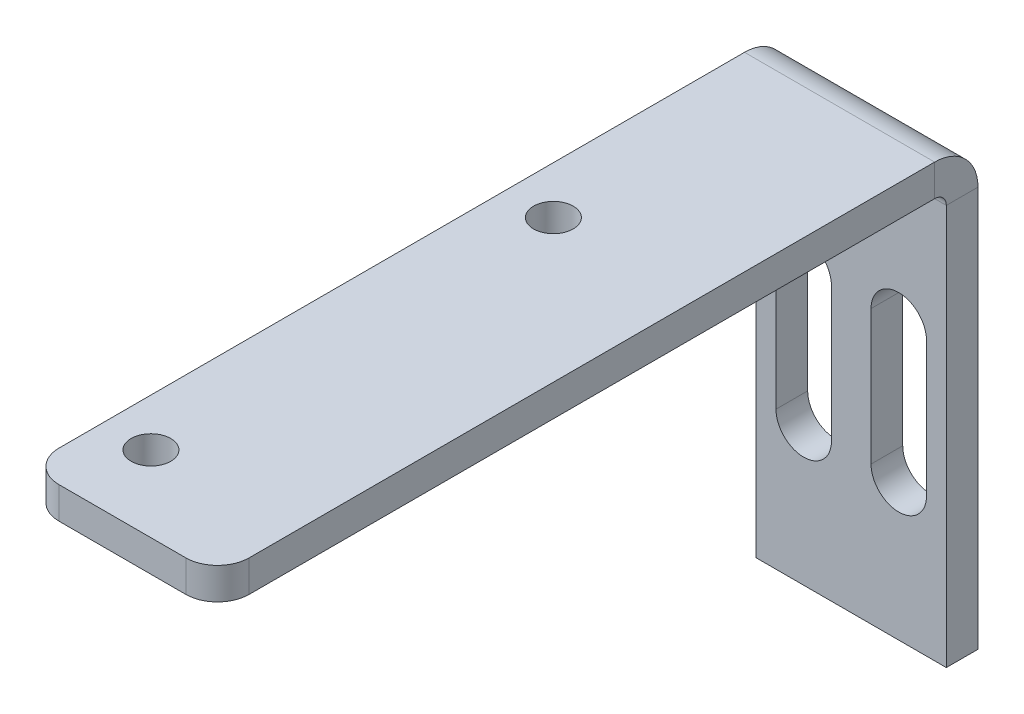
ISO-10303-21;
HEADER;
FILE_DESCRIPTION(('STEP AP214'),'2;1');
FILE_NAME('part.step','',(''),(''),'','','');
FILE_SCHEMA(('AUTOMOTIVE_DESIGN { 1 0 10303 214 1 1 1 1 }'));
ENDSEC;
DATA;
#1=APPLICATION_CONTEXT('core data for automotive mechanical design processes');
#2=APPLICATION_PROTOCOL_DEFINITION('international standard','automotive_design',2000,#1);
#3=PRODUCT_CONTEXT('',#1,'mechanical');
#4=PRODUCT('Part','Part','',(#3));
#5=PRODUCT_RELATED_PRODUCT_CATEGORY('part','',(#4));
#6=PRODUCT_DEFINITION_FORMATION('','',#4);
#7=PRODUCT_DEFINITION_CONTEXT('part definition',#1,'design');
#8=PRODUCT_DEFINITION('design','',#6,#7);
#9=PRODUCT_DEFINITION_SHAPE('','',#8);
#10=(LENGTH_UNIT() NAMED_UNIT(*) SI_UNIT(.MILLI.,.METRE.));
#11=(NAMED_UNIT(*) PLANE_ANGLE_UNIT() SI_UNIT($,.RADIAN.));
#12=(NAMED_UNIT(*) SI_UNIT($,.STERADIAN.) SOLID_ANGLE_UNIT());
#13=UNCERTAINTY_MEASURE_WITH_UNIT(LENGTH_MEASURE(1.E-05),#10,'distance_accuracy_value','');
#14=(GEOMETRIC_REPRESENTATION_CONTEXT(3) GLOBAL_UNCERTAINTY_ASSIGNED_CONTEXT((#13)) GLOBAL_UNIT_ASSIGNED_CONTEXT((#10,
#11,#12)) REPRESENTATION_CONTEXT('',''));
#15=CARTESIAN_POINT('',(0.,0.,0.));
#16=DIRECTION('',(0.,0.,1.));
#17=DIRECTION('',(1.,0.,0.));
#18=AXIS2_PLACEMENT_3D('',#15,#16,#17);
#19=CARTESIAN_POINT('',(0.,0.,0.));
#20=DIRECTION('',(0.,0.,1.));
#21=DIRECTION('',(1.,0.,0.));
#22=AXIS2_PLACEMENT_3D('',#19,#20,#21);
#23=PLANE('',#22);
#24=CARTESIAN_POINT('',(9.,182.48555223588,0.));
#25=DIRECTION('',(0.,0.,1.));
#26=DIRECTION('',(1.,0.,0.));
#27=AXIS2_PLACEMENT_3D('',#24,#25,#26);
#28=CIRCLE('',#27,1.75);
#29=CARTESIAN_POINT('',(7.25,182.48555223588,0.));
#30=VERTEX_POINT('',#29);
#31=CARTESIAN_POINT('',(10.75,182.48555223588,0.));
#32=VERTEX_POINT('',#31);
#33=EDGE_CURVE('E195',#30,#32,#28,.T.);
#34=ORIENTED_EDGE('',*,*,#33,.F.);
#35=DIRECTION('',(0.,-1.,0.));
#36=VECTOR('',#35,1.);
#37=CARTESIAN_POINT('',(7.25,190.985552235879,0.));
#38=LINE('',#37,#36);
#39=CARTESIAN_POINT('',(7.25,190.985552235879,0.));
#40=VERTEX_POINT('',#39);
#41=EDGE_CURVE('E171',#40,#30,#38,.T.);
#42=ORIENTED_EDGE('',*,*,#41,.F.);
#43=CARTESIAN_POINT('',(9.,190.985552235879,0.));
#44=DIRECTION('',(0.,0.,1.));
#45=DIRECTION('',(1.,0.,0.));
#46=AXIS2_PLACEMENT_3D('',#43,#44,#45);
#47=CIRCLE('',#46,1.75);
#48=CARTESIAN_POINT('',(10.75,190.985552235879,0.));
#49=VERTEX_POINT('',#48);
#50=EDGE_CURVE('E185',#49,#40,#47,.T.);
#51=ORIENTED_EDGE('',*,*,#50,.F.);
#52=DIRECTION('',(0.,-1.,0.));
#53=VECTOR('',#52,1.);
#54=CARTESIAN_POINT('',(10.75,190.985552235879,0.));
#55=LINE('',#54,#53);
#56=EDGE_CURVE('E179',#49,#32,#55,.T.);
#57=ORIENTED_EDGE('',*,*,#56,.T.);
#58=EDGE_LOOP('',(#34,#42,#51,#57));
#59=FACE_BOUND('',#58,.T.);
#60=DIRECTION('',(0.,1.,0.));
#61=VECTOR('',#60,1.);
#62=CARTESIAN_POINT('',(12.,173.73555223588,0.));
#63=LINE('',#62,#61);
#64=CARTESIAN_POINT('',(12.,173.73555223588,0.));
#65=VERTEX_POINT('',#64);
#66=CARTESIAN_POINT('',(12.,198.998952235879,0.));
#67=VERTEX_POINT('',#66);
#68=EDGE_CURVE('E251',#65,#67,#63,.T.);
#69=ORIENTED_EDGE('',*,*,#68,.T.);
#70=DIRECTION('',(-1.,0.,0.));
#71=VECTOR('',#70,1.);
#72=CARTESIAN_POINT('',(0.,198.998952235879,0.));
#73=LINE('',#72,#71);
#74=CARTESIAN_POINT('',(0.,198.998952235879,0.));
#75=VERTEX_POINT('',#74);
#76=EDGE_CURVE('E243',#75,#67,#73,.F.);
#77=ORIENTED_EDGE('',*,*,#76,.F.);
#78=DIRECTION('',(0.,-1.,0.));
#79=VECTOR('',#78,1.);
#80=CARTESIAN_POINT('',(0.,173.73555223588,0.));
#81=LINE('',#80,#79);
#82=CARTESIAN_POINT('',(0.,173.73555223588,0.));
#83=VERTEX_POINT('',#82);
#84=EDGE_CURVE('E266',#75,#83,#81,.T.);
#85=ORIENTED_EDGE('',*,*,#84,.T.);
#86=DIRECTION('',(1.,0.,0.));
#87=VECTOR('',#86,1.);
#88=CARTESIAN_POINT('',(12.,173.73555223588,0.));
#89=LINE('',#88,#87);
#90=EDGE_CURVE('E258',#83,#65,#89,.T.);
#91=ORIENTED_EDGE('',*,*,#90,.T.);
#92=EDGE_LOOP('',(#69,#77,#85,#91));
#93=FACE_BOUND('',#92,.T.);
#94=CARTESIAN_POINT('',(3.,190.985552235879,0.));
#95=DIRECTION('',(0.,0.,1.));
#96=DIRECTION('',(1.,0.,0.));
#97=AXIS2_PLACEMENT_3D('',#94,#95,#96);
#98=CIRCLE('',#97,1.75);
#99=CARTESIAN_POINT('',(4.75,190.985552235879,0.));
#100=VERTEX_POINT('',#99);
#101=CARTESIAN_POINT('',(1.25,190.985552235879,0.));
#102=VERTEX_POINT('',#101);
#103=EDGE_CURVE('E40',#100,#102,#98,.T.);
#104=ORIENTED_EDGE('',*,*,#103,.F.);
#105=DIRECTION('',(0.,-1.,0.));
#106=VECTOR('',#105,1.);
#107=CARTESIAN_POINT('',(4.75,190.985552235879,0.));
#108=LINE('',#107,#106);
#109=CARTESIAN_POINT('',(4.75,182.48555223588,0.));
#110=VERTEX_POINT('',#109);
#111=EDGE_CURVE('E144',#100,#110,#108,.T.);
#112=ORIENTED_EDGE('',*,*,#111,.T.);
#113=CARTESIAN_POINT('',(3.,182.48555223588,0.));
#114=DIRECTION('',(0.,0.,1.));
#115=DIRECTION('',(1.,0.,0.));
#116=AXIS2_PLACEMENT_3D('',#113,#114,#115);
#117=CIRCLE('',#116,1.75);
#118=CARTESIAN_POINT('',(1.24999999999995,182.48555223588,0.));
#119=VERTEX_POINT('',#118);
#120=EDGE_CURVE('E164',#119,#110,#117,.T.);
#121=ORIENTED_EDGE('',*,*,#120,.F.);
#122=DIRECTION('',(0.,-1.,0.));
#123=VECTOR('',#122,1.);
#124=CARTESIAN_POINT('',(1.24999999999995,190.985552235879,0.));
#125=LINE('',#124,#123);
#126=EDGE_CURVE('E157',#102,#119,#125,.T.);
#127=ORIENTED_EDGE('',*,*,#126,.F.);
#128=EDGE_LOOP('',(#104,#112,#121,#127));
#129=FACE_BOUND('',#128,.T.);
#130=ADVANCED_FACE('F16',(#59,#93,#129),#23,.T.);
#131=CARTESIAN_POINT('',(0.,0.,-2.));
#132=DIRECTION('',(0.,0.,1.));
#133=DIRECTION('',(1.,0.,0.));
#134=AXIS2_PLACEMENT_3D('',#131,#132,#133);
#135=PLANE('',#134);
#136=DIRECTION('',(0.,-1.,0.));
#137=VECTOR('',#136,1.);
#138=CARTESIAN_POINT('',(1.25,190.985552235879,-2.));
#139=LINE('',#138,#137);
#140=CARTESIAN_POINT('',(1.25,190.985552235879,-2.));
#141=VERTEX_POINT('',#140);
#142=CARTESIAN_POINT('',(1.25,182.48555223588,-2.));
#143=VERTEX_POINT('',#142);
#144=EDGE_CURVE('E292',#141,#143,#139,.T.);
#145=ORIENTED_EDGE('',*,*,#144,.T.);
#146=CARTESIAN_POINT('',(3.,182.48555223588,-2.));
#147=DIRECTION('',(0.,0.,1.));
#148=DIRECTION('',(1.,0.,0.));
#149=AXIS2_PLACEMENT_3D('',#146,#147,#148);
#150=CIRCLE('',#149,1.75);
#151=CARTESIAN_POINT('',(4.75,182.48555223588,-2.));
#152=VERTEX_POINT('',#151);
#153=EDGE_CURVE('E166',#143,#152,#150,.T.);
#154=ORIENTED_EDGE('',*,*,#153,.T.);
#155=DIRECTION('',(0.,-1.,0.));
#156=VECTOR('',#155,1.);
#157=CARTESIAN_POINT('',(4.75,190.985552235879,-2.));
#158=LINE('',#157,#156);
#159=CARTESIAN_POINT('',(4.75,190.985552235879,-2.));
#160=VERTEX_POINT('',#159);
#161=EDGE_CURVE('E149',#160,#152,#158,.T.);
#162=ORIENTED_EDGE('',*,*,#161,.F.);
#163=CARTESIAN_POINT('',(3.,190.985552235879,-2.));
#164=DIRECTION('',(0.,0.,1.));
#165=DIRECTION('',(1.,0.,0.));
#166=AXIS2_PLACEMENT_3D('',#163,#164,#165);
#167=CIRCLE('',#166,1.75);
#168=EDGE_CURVE('E153',#160,#141,#167,.T.);
#169=ORIENTED_EDGE('',*,*,#168,.T.);
#170=EDGE_LOOP('',(#145,#154,#162,#169));
#171=FACE_BOUND('',#170,.T.);
#172=DIRECTION('',(-1.,0.,0.));
#173=VECTOR('',#172,1.);
#174=CARTESIAN_POINT('',(0.,198.998952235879,-2.));
#175=LINE('',#174,#173);
#176=CARTESIAN_POINT('',(0.,198.998952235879,-2.));
#177=VERTEX_POINT('',#176);
#178=CARTESIAN_POINT('',(12.,198.998952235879,-2.));
#179=VERTEX_POINT('',#178);
#180=EDGE_CURVE('E231',#177,#179,#175,.F.);
#181=ORIENTED_EDGE('',*,*,#180,.T.);
#182=DIRECTION('',(0.,1.,0.));
#183=VECTOR('',#182,1.);
#184=CARTESIAN_POINT('',(12.,173.73555223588,-2.));
#185=LINE('',#184,#183);
#186=CARTESIAN_POINT('',(12.,173.73555223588,-2.));
#187=VERTEX_POINT('',#186);
#188=EDGE_CURVE('E254',#187,#179,#185,.T.);
#189=ORIENTED_EDGE('',*,*,#188,.F.);
#190=DIRECTION('',(1.,0.,0.));
#191=VECTOR('',#190,1.);
#192=CARTESIAN_POINT('',(12.,173.73555223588,-2.));
#193=LINE('',#192,#191);
#194=CARTESIAN_POINT('',(0.,173.73555223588,-2.));
#195=VERTEX_POINT('',#194);
#196=EDGE_CURVE('E260',#195,#187,#193,.T.);
#197=ORIENTED_EDGE('',*,*,#196,.F.);
#198=DIRECTION('',(0.,-1.,0.));
#199=VECTOR('',#198,1.);
#200=CARTESIAN_POINT('',(0.,173.73555223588,-2.));
#201=LINE('',#200,#199);
#202=EDGE_CURVE('E257',#177,#195,#201,.T.);
#203=ORIENTED_EDGE('',*,*,#202,.F.);
#204=EDGE_LOOP('',(#181,#189,#197,#203));
#205=FACE_BOUND('',#204,.T.);
#206=DIRECTION('',(0.,-1.,0.));
#207=VECTOR('',#206,1.);
#208=CARTESIAN_POINT('',(10.75,190.985552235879,-2.));
#209=LINE('',#208,#207);
#210=CARTESIAN_POINT('',(10.75,190.985552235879,-2.));
#211=VERTEX_POINT('',#210);
#212=CARTESIAN_POINT('',(10.75,182.48555223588,-2.));
#213=VERTEX_POINT('',#212);
#214=EDGE_CURVE('E176',#211,#213,#209,.T.);
#215=ORIENTED_EDGE('',*,*,#214,.F.);
#216=CARTESIAN_POINT('',(9.,190.985552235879,-2.));
#217=DIRECTION('',(0.,0.,1.));
#218=DIRECTION('',(1.,0.,0.));
#219=AXIS2_PLACEMENT_3D('',#216,#217,#218);
#220=CIRCLE('',#219,1.75);
#221=CARTESIAN_POINT('',(7.25,190.985552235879,-2.));
#222=VERTEX_POINT('',#221);
#223=EDGE_CURVE('E187',#211,#222,#220,.T.);
#224=ORIENTED_EDGE('',*,*,#223,.T.);
#225=DIRECTION('',(0.,-1.,0.));
#226=VECTOR('',#225,1.);
#227=CARTESIAN_POINT('',(7.25,190.985552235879,-2.));
#228=LINE('',#227,#226);
#229=CARTESIAN_POINT('',(7.25,182.48555223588,-2.));
#230=VERTEX_POINT('',#229);
#231=EDGE_CURVE('E173',#222,#230,#228,.T.);
#232=ORIENTED_EDGE('',*,*,#231,.T.);
#233=CARTESIAN_POINT('',(9.,182.48555223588,-2.));
#234=DIRECTION('',(0.,0.,1.));
#235=DIRECTION('',(1.,0.,0.));
#236=AXIS2_PLACEMENT_3D('',#233,#234,#235);
#237=CIRCLE('',#236,1.75);
#238=EDGE_CURVE('E197',#230,#213,#237,.T.);
#239=ORIENTED_EDGE('',*,*,#238,.T.);
#240=EDGE_LOOP('',(#215,#224,#232,#239));
#241=FACE_BOUND('',#240,.T.);
#242=ADVANCED_FACE('F306',(#171,#205,#241),#135,.F.);
#243=CARTESIAN_POINT('',(0.,173.73555223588,-2.));
#244=DIRECTION('',(-1.,0.,0.));
#245=DIRECTION('',(0.,0.,1.));
#246=AXIS2_PLACEMENT_3D('',#243,#244,#245);
#247=PLANE('',#246);
#248=ORIENTED_EDGE('',*,*,#84,.F.);
#249=DIRECTION('',(0.,0.,-1.));
#250=VECTOR('',#249,1.);
#251=CARTESIAN_POINT('',(0.,198.998952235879,0.));
#252=LINE('',#251,#250);
#253=EDGE_CURVE('E237',#75,#177,#252,.T.);
#254=ORIENTED_EDGE('',*,*,#253,.T.);
#255=ORIENTED_EDGE('',*,*,#202,.T.);
#256=DIRECTION('',(0.,0.,1.));
#257=VECTOR('',#256,1.);
#258=CARTESIAN_POINT('',(0.,173.73555223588,-2.));
#259=LINE('',#258,#257);
#260=EDGE_CURVE('E263',#195,#83,#259,.T.);
#261=ORIENTED_EDGE('',*,*,#260,.T.);
#262=EDGE_LOOP('',(#248,#254,#255,#261));
#263=FACE_BOUND('',#262,.T.);
#264=ADVANCED_FACE('F332',(#263),#247,.T.);
#265=CARTESIAN_POINT('',(12.,173.73555223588,-2.));
#266=DIRECTION('',(1.,0.,0.));
#267=DIRECTION('',(0.,0.,-1.));
#268=AXIS2_PLACEMENT_3D('',#265,#266,#267);
#269=PLANE('',#268);
#270=DIRECTION('',(0.,0.,-1.));
#271=VECTOR('',#270,1.);
#272=CARTESIAN_POINT('',(12.,198.998952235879,0.));
#273=LINE('',#272,#271);
#274=EDGE_CURVE('E248',#67,#179,#273,.T.);
#275=ORIENTED_EDGE('',*,*,#274,.F.);
#276=ORIENTED_EDGE('',*,*,#68,.F.);
#277=DIRECTION('',(0.,0.,1.));
#278=VECTOR('',#277,1.);
#279=CARTESIAN_POINT('',(12.,173.73555223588,-2.));
#280=LINE('',#279,#278);
#281=EDGE_CURVE('E270',#187,#65,#280,.T.);
#282=ORIENTED_EDGE('',*,*,#281,.F.);
#283=ORIENTED_EDGE('',*,*,#188,.T.);
#284=EDGE_LOOP('',(#275,#276,#282,#283));
#285=FACE_BOUND('',#284,.T.);
#286=ADVANCED_FACE('F342',(#285),#269,.T.);
#287=CARTESIAN_POINT('',(12.,173.73555223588,-2.));
#288=DIRECTION('',(0.,-1.,0.));
#289=DIRECTION('',(0.,0.,-1.));
#290=AXIS2_PLACEMENT_3D('',#287,#288,#289);
#291=PLANE('',#290);
#292=ORIENTED_EDGE('',*,*,#90,.F.);
#293=ORIENTED_EDGE('',*,*,#260,.F.);
#294=ORIENTED_EDGE('',*,*,#196,.T.);
#295=ORIENTED_EDGE('',*,*,#281,.T.);
#296=EDGE_LOOP('',(#292,#293,#294,#295));
#297=FACE_BOUND('',#296,.T.);
#298=ADVANCED_FACE('F338',(#297),#291,.T.);
#299=CARTESIAN_POINT('',(12.,198.998952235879,0.7366));
#300=DIRECTION('',(1.,0.,0.));
#301=DIRECTION('',(0.,0.,-1.));
#302=AXIS2_PLACEMENT_3D('',#299,#300,#301);
#303=PLANE('',#302);
#304=DIRECTION('',(0.,-1.,0.));
#305=VECTOR('',#304,1.);
#306=CARTESIAN_POINT('',(12.,201.735552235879,0.7366));
#307=LINE('',#306,#305);
#308=CARTESIAN_POINT('',(12.,199.735552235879,0.7366));
#309=VERTEX_POINT('',#308);
#310=CARTESIAN_POINT('',(12.,201.735552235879,0.7366));
#311=VERTEX_POINT('',#310);
#312=EDGE_CURVE('E203',#309,#311,#307,.F.);
#313=ORIENTED_EDGE('',*,*,#312,.F.);
#314=CARTESIAN_POINT('',(12.,198.998952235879,0.7366));
#315=DIRECTION('',(-1.,0.,0.));
#316=DIRECTION('',(0.,0.,1.));
#317=AXIS2_PLACEMENT_3D('',#314,#315,#316);
#318=CIRCLE('',#317,0.7366);
#319=EDGE_CURVE('E240',#67,#309,#318,.F.);
#320=ORIENTED_EDGE('',*,*,#319,.F.);
#321=ORIENTED_EDGE('',*,*,#274,.T.);
#322=CARTESIAN_POINT('',(12.,198.998952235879,0.7366));
#323=DIRECTION('',(-1.,0.,0.));
#324=DIRECTION('',(0.,0.,1.));
#325=AXIS2_PLACEMENT_3D('',#322,#323,#324);
#326=CIRCLE('',#325,2.7366);
#327=EDGE_CURVE('E233',#179,#311,#326,.F.);
#328=ORIENTED_EDGE('',*,*,#327,.T.);
#329=EDGE_LOOP('',(#313,#320,#321,#328));
#330=FACE_BOUND('',#329,.T.);
#331=ADVANCED_FACE('F341',(#330),#303,.T.);
#332=CARTESIAN_POINT('',(0.,198.998952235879,0.7366));
#333=DIRECTION('',(1.,0.,0.));
#334=DIRECTION('',(0.,0.,-1.));
#335=AXIS2_PLACEMENT_3D('',#332,#333,#334);
#336=PLANE('',#335);
#337=CARTESIAN_POINT('',(0.,198.998952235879,0.7366));
#338=DIRECTION('',(-1.,0.,0.));
#339=DIRECTION('',(0.,0.,1.));
#340=AXIS2_PLACEMENT_3D('',#337,#338,#339);
#341=CIRCLE('',#340,0.7366);
#342=CARTESIAN_POINT('',(0.,199.735552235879,0.7366));
#343=VERTEX_POINT('',#342);
#344=EDGE_CURVE('E207',#343,#75,#341,.T.);
#345=ORIENTED_EDGE('',*,*,#344,.F.);
#346=DIRECTION('',(0.,-1.,0.));
#347=VECTOR('',#346,1.);
#348=CARTESIAN_POINT('',(0.,199.735552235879,0.7366));
#349=LINE('',#348,#347);
#350=CARTESIAN_POINT('',(0.,201.735552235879,0.7366));
#351=VERTEX_POINT('',#350);
#352=EDGE_CURVE('E224',#343,#351,#349,.F.);
#353=ORIENTED_EDGE('',*,*,#352,.T.);
#354=CARTESIAN_POINT('',(0.,198.998952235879,0.7366));
#355=DIRECTION('',(-1.,0.,0.));
#356=DIRECTION('',(0.,0.,1.));
#357=AXIS2_PLACEMENT_3D('',#354,#355,#356);
#358=CIRCLE('',#357,2.7366);
#359=EDGE_CURVE('E234',#351,#177,#358,.T.);
#360=ORIENTED_EDGE('',*,*,#359,.T.);
#361=ORIENTED_EDGE('',*,*,#253,.F.);
#362=EDGE_LOOP('',(#345,#353,#360,#361));
#363=FACE_BOUND('',#362,.T.);
#364=ADVANCED_FACE('F393',(#363),#336,.F.);
#365=CARTESIAN_POINT('',(0.,198.998952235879,0.7366));
#366=DIRECTION('',(-1.,0.,0.));
#367=DIRECTION('',(0.,1.,0.));
#368=AXIS2_PLACEMENT_3D('',#365,#366,#367);
#369=CYLINDRICAL_SURFACE('',#368,2.7366);
#370=ORIENTED_EDGE('',*,*,#180,.F.);
#371=ORIENTED_EDGE('',*,*,#359,.F.);
#372=DIRECTION('',(-1.,0.,0.));
#373=VECTOR('',#372,1.);
#374=CARTESIAN_POINT('',(12.,201.735552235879,0.7366));
#375=LINE('',#374,#373);
#376=EDGE_CURVE('E221',#351,#311,#375,.F.);
#377=ORIENTED_EDGE('',*,*,#376,.T.);
#378=ORIENTED_EDGE('',*,*,#327,.F.);
#379=EDGE_LOOP('',(#370,#371,#377,#378));
#380=FACE_BOUND('',#379,.T.);
#381=ADVANCED_FACE('F397',(#380),#369,.T.);
#382=CARTESIAN_POINT('',(0.,198.998952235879,0.7366));
#383=DIRECTION('',(-1.,0.,0.));
#384=DIRECTION('',(0.,1.,0.));
#385=AXIS2_PLACEMENT_3D('',#382,#383,#384);
#386=CYLINDRICAL_SURFACE('',#385,0.7366);
#387=ORIENTED_EDGE('',*,*,#76,.T.);
#388=ORIENTED_EDGE('',*,*,#319,.T.);
#389=DIRECTION('',(-1.,0.,0.));
#390=VECTOR('',#389,1.);
#391=CARTESIAN_POINT('',(12.,199.735552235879,0.7366));
#392=LINE('',#391,#390);
#393=EDGE_CURVE('E227',#309,#343,#392,.T.);
#394=ORIENTED_EDGE('',*,*,#393,.T.);
#395=ORIENTED_EDGE('',*,*,#344,.T.);
#396=EDGE_LOOP('',(#387,#388,#394,#395));
#397=FACE_BOUND('',#396,.T.);
#398=ADVANCED_FACE('F385',(#397),#386,.F.);
#399=CARTESIAN_POINT('',(12.,201.735552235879,0.));
#400=DIRECTION('',(-1.,0.,0.));
#401=DIRECTION('',(0.,0.,1.));
#402=AXIS2_PLACEMENT_3D('',#399,#400,#401);
#403=PLANE('',#402);
#404=DIRECTION('',(0.,0.,-1.));
#405=VECTOR('',#404,1.);
#406=CARTESIAN_POINT('',(12.,201.735552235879,-7.37324663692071E-13));
#407=LINE('',#406,#405);
#408=CARTESIAN_POINT('',(12.,201.73555223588,44.));
#409=VERTEX_POINT('',#408);
#410=EDGE_CURVE('E211',#409,#311,#407,.T.);
#411=ORIENTED_EDGE('',*,*,#410,.F.);
#412=DIRECTION('',(0.,-1.,0.));
#413=VECTOR('',#412,1.);
#414=CARTESIAN_POINT('',(12.,201.73555223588,44.));
#415=LINE('',#414,#413);
#416=CARTESIAN_POINT('',(12.,199.73555223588,44.));
#417=VERTEX_POINT('',#416);
#418=EDGE_CURVE('E11',#409,#417,#415,.T.);
#419=ORIENTED_EDGE('',*,*,#418,.T.);
#420=DIRECTION('',(0.,0.,1.));
#421=VECTOR('',#420,1.);
#422=CARTESIAN_POINT('',(12.,199.735552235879,0.));
#423=LINE('',#422,#421);
#424=EDGE_CURVE('E219',#417,#309,#423,.F.);
#425=ORIENTED_EDGE('',*,*,#424,.T.);
#426=ORIENTED_EDGE('',*,*,#312,.T.);
#427=EDGE_LOOP('',(#411,#419,#425,#426));
#428=FACE_BOUND('',#427,.T.);
#429=ADVANCED_FACE('F377',(#428),#403,.F.);
#430=CARTESIAN_POINT('',(0.,201.73555223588,46.));
#431=DIRECTION('',(1.,0.,0.));
#432=DIRECTION('',(0.,0.,-1.));
#433=AXIS2_PLACEMENT_3D('',#430,#431,#432);
#434=PLANE('',#433);
#435=DIRECTION('',(0.,0.,-1.));
#436=VECTOR('',#435,1.);
#437=CARTESIAN_POINT('',(0.,199.73555223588,46.));
#438=LINE('',#437,#436);
#439=CARTESIAN_POINT('',(0.,199.73555223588,44.));
#440=VERTEX_POINT('',#439);
#441=EDGE_CURVE('E216',#343,#440,#438,.F.);
#442=ORIENTED_EDGE('',*,*,#441,.T.);
#443=DIRECTION('',(0.,-1.,0.));
#444=VECTOR('',#443,1.);
#445=CARTESIAN_POINT('',(0.,201.73555223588,44.));
#446=LINE('',#445,#444);
#447=CARTESIAN_POINT('',(0.,201.73555223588,44.));
#448=VERTEX_POINT('',#447);
#449=EDGE_CURVE('E283',#440,#448,#446,.F.);
#450=ORIENTED_EDGE('',*,*,#449,.T.);
#451=DIRECTION('',(0.,0.,1.));
#452=VECTOR('',#451,1.);
#453=CARTESIAN_POINT('',(0.,201.735552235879,-7.37324663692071E-13));
#454=LINE('',#453,#452);
#455=EDGE_CURVE('E208',#351,#448,#454,.T.);
#456=ORIENTED_EDGE('',*,*,#455,.F.);
#457=ORIENTED_EDGE('',*,*,#352,.F.);
#458=EDGE_LOOP('',(#442,#450,#456,#457));
#459=FACE_BOUND('',#458,.T.);
#460=ADVANCED_FACE('F391',(#459),#434,.F.);
#461=CARTESIAN_POINT('',(0.,201.735552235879,-7.37324663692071E-13));
#462=DIRECTION('',(0.,-1.,0.));
#463=DIRECTION('',(0.,0.,-1.));
#464=AXIS2_PLACEMENT_3D('',#461,#462,#463);
#465=PLANE('',#464);
#466=CARTESIAN_POINT('',(3.,201.735552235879,15.8000000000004));
#467=DIRECTION('',(0.,1.,0.));
#468=DIRECTION('',(0.,0.,1.));
#469=AXIS2_PLACEMENT_3D('',#466,#467,#468);
#470=CIRCLE('',#469,1.24999999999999);
#471=CARTESIAN_POINT('',(3.,201.735552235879,17.0500000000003));
#472=VERTEX_POINT('',#471);
#473=EDGE_CURVE('E299',#472,#472,#470,.T.);
#474=ORIENTED_EDGE('',*,*,#473,.F.);
#475=EDGE_LOOP('',(#474));
#476=FACE_BOUND('',#475,.T.);
#477=CARTESIAN_POINT('',(3.,201.73555223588,41.2));
#478=DIRECTION('',(0.,1.,0.));
#479=DIRECTION('',(0.,0.,1.));
#480=AXIS2_PLACEMENT_3D('',#477,#478,#479);
#481=CIRCLE('',#480,1.24999999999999);
#482=CARTESIAN_POINT('',(3.,201.73555223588,42.45));
#483=VERTEX_POINT('',#482);
#484=EDGE_CURVE('E289',#483,#483,#481,.T.);
#485=ORIENTED_EDGE('',*,*,#484,.F.);
#486=EDGE_LOOP('',(#485));
#487=FACE_BOUND('',#486,.T.);
#488=ORIENTED_EDGE('',*,*,#455,.T.);
#489=CARTESIAN_POINT('',(2.,201.73555223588,44.));
#490=DIRECTION('',(0.,-1.,0.));
#491=DIRECTION('',(0.,0.,-1.));
#492=AXIS2_PLACEMENT_3D('',#489,#490,#491);
#493=CIRCLE('',#492,2.);
#494=CARTESIAN_POINT('',(2.,201.73555223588,46.));
#495=VERTEX_POINT('',#494);
#496=EDGE_CURVE('E25',#448,#495,#493,.F.);
#497=ORIENTED_EDGE('',*,*,#496,.T.);
#498=DIRECTION('',(1.,0.,0.));
#499=VECTOR('',#498,1.);
#500=CARTESIAN_POINT('',(0.,201.73555223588,46.));
#501=LINE('',#500,#499);
#502=CARTESIAN_POINT('',(10.,201.73555223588,46.));
#503=VERTEX_POINT('',#502);
#504=EDGE_CURVE('E204',#495,#503,#501,.T.);
#505=ORIENTED_EDGE('',*,*,#504,.T.);
#506=CARTESIAN_POINT('',(10.,201.73555223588,44.));
#507=DIRECTION('',(0.,-1.,0.));
#508=DIRECTION('',(0.,0.,-1.));
#509=AXIS2_PLACEMENT_3D('',#506,#507,#508);
#510=CIRCLE('',#509,2.);
#511=EDGE_CURVE('E285',#503,#409,#510,.F.);
#512=ORIENTED_EDGE('',*,*,#511,.T.);
#513=ORIENTED_EDGE('',*,*,#410,.T.);
#514=ORIENTED_EDGE('',*,*,#376,.F.);
#515=EDGE_LOOP('',(#488,#497,#505,#512,#513,#514));
#516=FACE_BOUND('',#515,.T.);
#517=ADVANCED_FACE('F368',(#476,#487,#516),#465,.F.);
#518=CARTESIAN_POINT('',(0.,199.735552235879,-7.30341701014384E-13));
#519=DIRECTION('',(0.,-1.,0.));
#520=DIRECTION('',(0.,0.,-1.));
#521=AXIS2_PLACEMENT_3D('',#518,#519,#520);
#522=PLANE('',#521);
#523=CARTESIAN_POINT('',(3.,199.735552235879,15.8000000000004));
#524=DIRECTION('',(0.,-1.,0.));
#525=DIRECTION('',(0.,0.,-1.));
#526=AXIS2_PLACEMENT_3D('',#523,#524,#525);
#527=CIRCLE('',#526,1.25);
#528=CARTESIAN_POINT('',(3.,199.735552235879,14.5500000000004));
#529=VERTEX_POINT('',#528);
#530=EDGE_CURVE('E20',#529,#529,#527,.T.);
#531=ORIENTED_EDGE('',*,*,#530,.F.);
#532=EDGE_LOOP('',(#531));
#533=FACE_BOUND('',#532,.T.);
#534=CARTESIAN_POINT('',(3.,199.73555223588,41.2));
#535=DIRECTION('',(0.,-1.,0.));
#536=DIRECTION('',(0.,0.,-1.));
#537=AXIS2_PLACEMENT_3D('',#534,#535,#536);
#538=CIRCLE('',#537,1.25);
#539=CARTESIAN_POINT('',(3.,199.73555223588,39.95));
#540=VERTEX_POINT('',#539);
#541=EDGE_CURVE('E287',#540,#540,#538,.T.);
#542=ORIENTED_EDGE('',*,*,#541,.F.);
#543=EDGE_LOOP('',(#542));
#544=FACE_BOUND('',#543,.T.);
#545=DIRECTION('',(-1.,0.,0.));
#546=VECTOR('',#545,1.);
#547=CARTESIAN_POINT('',(12.,199.73555223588,46.));
#548=LINE('',#547,#546);
#549=CARTESIAN_POINT('',(2.,199.73555223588,46.));
#550=VERTEX_POINT('',#549);
#551=CARTESIAN_POINT('',(10.,199.73555223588,46.));
#552=VERTEX_POINT('',#551);
#553=EDGE_CURVE('E213',#550,#552,#548,.F.);
#554=ORIENTED_EDGE('',*,*,#553,.F.);
#555=CARTESIAN_POINT('',(2.,199.73555223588,44.));
#556=DIRECTION('',(0.,-1.,0.));
#557=DIRECTION('',(0.,0.,-1.));
#558=AXIS2_PLACEMENT_3D('',#555,#556,#557);
#559=CIRCLE('',#558,2.);
#560=EDGE_CURVE('E281',#550,#440,#559,.T.);
#561=ORIENTED_EDGE('',*,*,#560,.T.);
#562=ORIENTED_EDGE('',*,*,#441,.F.);
#563=ORIENTED_EDGE('',*,*,#393,.F.);
#564=ORIENTED_EDGE('',*,*,#424,.F.);
#565=CARTESIAN_POINT('',(10.,199.73555223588,44.));
#566=DIRECTION('',(0.,-1.,0.));
#567=DIRECTION('',(0.,0.,-1.));
#568=AXIS2_PLACEMENT_3D('',#565,#566,#567);
#569=CIRCLE('',#568,2.);
#570=EDGE_CURVE('E279',#417,#552,#569,.T.);
#571=ORIENTED_EDGE('',*,*,#570,.T.);
#572=EDGE_LOOP('',(#554,#561,#562,#563,#564,#571));
#573=FACE_BOUND('',#572,.T.);
#574=ADVANCED_FACE('F360',(#533,#544,#573),#522,.T.);
#575=CARTESIAN_POINT('',(12.,201.73555223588,46.));
#576=DIRECTION('',(0.,0.,-1.));
#577=DIRECTION('',(0.,1.,0.));
#578=AXIS2_PLACEMENT_3D('',#575,#576,#577);
#579=PLANE('',#578);
#580=ORIENTED_EDGE('',*,*,#504,.F.);
#581=DIRECTION('',(0.,-1.,0.));
#582=VECTOR('',#581,1.);
#583=CARTESIAN_POINT('',(2.,201.73555223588,46.));
#584=LINE('',#583,#582);
#585=EDGE_CURVE('E276',#495,#550,#584,.T.);
#586=ORIENTED_EDGE('',*,*,#585,.T.);
#587=ORIENTED_EDGE('',*,*,#553,.T.);
#588=DIRECTION('',(0.,-1.,0.));
#589=VECTOR('',#588,1.);
#590=CARTESIAN_POINT('',(10.,201.73555223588,46.));
#591=LINE('',#590,#589);
#592=EDGE_CURVE('E272',#552,#503,#591,.F.);
#593=ORIENTED_EDGE('',*,*,#592,.T.);
#594=EDGE_LOOP('',(#580,#586,#587,#593));
#595=FACE_BOUND('',#594,.T.);
#596=ADVANCED_FACE('F351',(#595),#579,.F.);
#597=CARTESIAN_POINT('',(2.,201.73555223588,44.));
#598=DIRECTION('',(0.,-1.,0.));
#599=DIRECTION('',(0.,0.,-1.));
#600=AXIS2_PLACEMENT_3D('',#597,#598,#599);
#601=CYLINDRICAL_SURFACE('',#600,2.);
#602=ORIENTED_EDGE('',*,*,#496,.F.);
#603=ORIENTED_EDGE('',*,*,#449,.F.);
#604=ORIENTED_EDGE('',*,*,#560,.F.);
#605=ORIENTED_EDGE('',*,*,#585,.F.);
#606=EDGE_LOOP('',(#602,#603,#604,#605));
#607=FACE_BOUND('',#606,.T.);
#608=ADVANCED_FACE('F349',(#607),#601,.T.);
#609=CARTESIAN_POINT('',(10.,201.73555223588,44.));
#610=DIRECTION('',(0.,-1.,0.));
#611=DIRECTION('',(0.,0.,-1.));
#612=AXIS2_PLACEMENT_3D('',#609,#610,#611);
#613=CYLINDRICAL_SURFACE('',#612,2.);
#614=ORIENTED_EDGE('',*,*,#511,.F.);
#615=ORIENTED_EDGE('',*,*,#592,.F.);
#616=ORIENTED_EDGE('',*,*,#570,.F.);
#617=ORIENTED_EDGE('',*,*,#418,.F.);
#618=EDGE_LOOP('',(#614,#615,#616,#617));
#619=FACE_BOUND('',#618,.T.);
#620=ADVANCED_FACE('F18',(#619),#613,.T.);
#621=CARTESIAN_POINT('',(9.,182.48555223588,0.));
#622=DIRECTION('',(0.,0.,1.));
#623=DIRECTION('',(1.,0.,0.));
#624=AXIS2_PLACEMENT_3D('',#621,#622,#623);
#625=CYLINDRICAL_SURFACE('',#624,1.75);
#626=ORIENTED_EDGE('',*,*,#33,.T.);
#627=DIRECTION('',(0.,0.,-1.));
#628=VECTOR('',#627,1.);
#629=CARTESIAN_POINT('',(10.75,182.48555223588,-2.));
#630=LINE('',#629,#628);
#631=EDGE_CURVE('E193',#32,#213,#630,.T.);
#632=ORIENTED_EDGE('',*,*,#631,.T.);
#633=ORIENTED_EDGE('',*,*,#238,.F.);
#634=DIRECTION('',(0.,0.,1.));
#635=VECTOR('',#634,1.);
#636=CARTESIAN_POINT('',(7.25,182.48555223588,0.));
#637=LINE('',#636,#635);
#638=EDGE_CURVE('E200',#30,#230,#637,.F.);
#639=ORIENTED_EDGE('',*,*,#638,.F.);
#640=EDGE_LOOP('',(#626,#632,#633,#639));
#641=FACE_BOUND('',#640,.T.);
#642=ADVANCED_FACE('F358',(#641),#625,.F.);
#643=CARTESIAN_POINT('',(9.,190.985552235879,0.));
#644=DIRECTION('',(0.,0.,1.));
#645=DIRECTION('',(1.,0.,0.));
#646=AXIS2_PLACEMENT_3D('',#643,#644,#645);
#647=CYLINDRICAL_SURFACE('',#646,1.75);
#648=ORIENTED_EDGE('',*,*,#223,.F.);
#649=DIRECTION('',(0.,0.,-1.));
#650=VECTOR('',#649,1.);
#651=CARTESIAN_POINT('',(10.75,190.985552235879,-2.));
#652=LINE('',#651,#650);
#653=EDGE_CURVE('E182',#49,#211,#652,.T.);
#654=ORIENTED_EDGE('',*,*,#653,.F.);
#655=ORIENTED_EDGE('',*,*,#50,.T.);
#656=DIRECTION('',(0.,0.,1.));
#657=VECTOR('',#656,1.);
#658=CARTESIAN_POINT('',(7.25,190.985552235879,0.));
#659=LINE('',#658,#657);
#660=EDGE_CURVE('E190',#222,#40,#659,.T.);
#661=ORIENTED_EDGE('',*,*,#660,.F.);
#662=EDGE_LOOP('',(#648,#654,#655,#661));
#663=FACE_BOUND('',#662,.T.);
#664=ADVANCED_FACE('F412',(#663),#647,.F.);
#665=CARTESIAN_POINT('',(10.75,190.985552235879,-2.));
#666=DIRECTION('',(-1.,0.,0.));
#667=DIRECTION('',(0.,0.,1.));
#668=AXIS2_PLACEMENT_3D('',#665,#666,#667);
#669=PLANE('',#668);
#670=ORIENTED_EDGE('',*,*,#631,.F.);
#671=ORIENTED_EDGE('',*,*,#56,.F.);
#672=ORIENTED_EDGE('',*,*,#653,.T.);
#673=ORIENTED_EDGE('',*,*,#214,.T.);
#674=EDGE_LOOP('',(#670,#671,#672,#673));
#675=FACE_BOUND('',#674,.T.);
#676=ADVANCED_FACE('F408',(#675),#669,.T.);
#677=CARTESIAN_POINT('',(7.25,190.985552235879,0.));
#678=DIRECTION('',(-1.,0.,0.));
#679=DIRECTION('',(0.,0.,1.));
#680=AXIS2_PLACEMENT_3D('',#677,#678,#679);
#681=PLANE('',#680);
#682=ORIENTED_EDGE('',*,*,#638,.T.);
#683=ORIENTED_EDGE('',*,*,#231,.F.);
#684=ORIENTED_EDGE('',*,*,#660,.T.);
#685=ORIENTED_EDGE('',*,*,#41,.T.);
#686=EDGE_LOOP('',(#682,#683,#684,#685));
#687=FACE_BOUND('',#686,.T.);
#688=ADVANCED_FACE('F417',(#687),#681,.F.);
#689=CARTESIAN_POINT('',(3.,182.48555223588,0.));
#690=DIRECTION('',(0.,0.,1.));
#691=DIRECTION('',(1.,0.,0.));
#692=AXIS2_PLACEMENT_3D('',#689,#690,#691);
#693=CYLINDRICAL_SURFACE('',#692,1.75);
#694=ORIENTED_EDGE('',*,*,#120,.T.);
#695=DIRECTION('',(0.,0.,-1.));
#696=VECTOR('',#695,1.);
#697=CARTESIAN_POINT('',(4.75,182.48555223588,-2.));
#698=LINE('',#697,#696);
#699=EDGE_CURVE('E146',#110,#152,#698,.T.);
#700=ORIENTED_EDGE('',*,*,#699,.T.);
#701=ORIENTED_EDGE('',*,*,#153,.F.);
#702=DIRECTION('',(0.,0.,1.));
#703=VECTOR('',#702,1.);
#704=CARTESIAN_POINT('',(1.25,182.48555223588,0.));
#705=LINE('',#704,#703);
#706=EDGE_CURVE('E169',#119,#143,#705,.F.);
#707=ORIENTED_EDGE('',*,*,#706,.F.);
#708=EDGE_LOOP('',(#694,#700,#701,#707));
#709=FACE_BOUND('',#708,.T.);
#710=ADVANCED_FACE('F310',(#709),#693,.F.);
#711=CARTESIAN_POINT('',(3.,190.985552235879,0.));
#712=DIRECTION('',(0.,0.,1.));
#713=DIRECTION('',(1.,0.,0.));
#714=AXIS2_PLACEMENT_3D('',#711,#712,#713);
#715=CYLINDRICAL_SURFACE('',#714,1.75);
#716=ORIENTED_EDGE('',*,*,#168,.F.);
#717=DIRECTION('',(0.,0.,-1.));
#718=VECTOR('',#717,1.);
#719=CARTESIAN_POINT('',(4.75,190.985552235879,-2.));
#720=LINE('',#719,#718);
#721=EDGE_CURVE('E33',#100,#160,#720,.T.);
#722=ORIENTED_EDGE('',*,*,#721,.F.);
#723=ORIENTED_EDGE('',*,*,#103,.T.);
#724=DIRECTION('',(0.,0.,1.));
#725=VECTOR('',#724,1.);
#726=CARTESIAN_POINT('',(1.25,190.985552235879,0.));
#727=LINE('',#726,#725);
#728=EDGE_CURVE('E159',#141,#102,#727,.T.);
#729=ORIENTED_EDGE('',*,*,#728,.F.);
#730=EDGE_LOOP('',(#716,#722,#723,#729));
#731=FACE_BOUND('',#730,.T.);
#732=ADVANCED_FACE('F151',(#731),#715,.F.);
#733=CARTESIAN_POINT('',(4.75,190.985552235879,-2.));
#734=DIRECTION('',(-1.,0.,0.));
#735=DIRECTION('',(0.,0.,1.));
#736=AXIS2_PLACEMENT_3D('',#733,#734,#735);
#737=PLANE('',#736);
#738=ORIENTED_EDGE('',*,*,#699,.F.);
#739=ORIENTED_EDGE('',*,*,#111,.F.);
#740=ORIENTED_EDGE('',*,*,#721,.T.);
#741=ORIENTED_EDGE('',*,*,#161,.T.);
#742=EDGE_LOOP('',(#738,#739,#740,#741));
#743=FACE_BOUND('',#742,.T.);
#744=ADVANCED_FACE('F145',(#743),#737,.T.);
#745=CARTESIAN_POINT('',(1.25,190.985552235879,0.));
#746=DIRECTION('',(-1.,0.,0.));
#747=DIRECTION('',(0.,0.,1.));
#748=AXIS2_PLACEMENT_3D('',#745,#746,#747);
#749=PLANE('',#748);
#750=ORIENTED_EDGE('',*,*,#706,.T.);
#751=ORIENTED_EDGE('',*,*,#144,.F.);
#752=ORIENTED_EDGE('',*,*,#728,.T.);
#753=ORIENTED_EDGE('',*,*,#126,.T.);
#754=EDGE_LOOP('',(#750,#751,#752,#753));
#755=FACE_BOUND('',#754,.T.);
#756=ADVANCED_FACE('F312',(#755),#749,.F.);
#757=CARTESIAN_POINT('',(3.,201.73555223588,41.2));
#758=DIRECTION('',(0.,1.,0.));
#759=DIRECTION('',(0.,0.,1.));
#760=AXIS2_PLACEMENT_3D('',#757,#758,#759);
#761=CYLINDRICAL_SURFACE('',#760,1.25);
#762=ORIENTED_EDGE('',*,*,#541,.T.);
#763=EDGE_LOOP('',(#762));
#764=FACE_BOUND('',#763,.T.);
#765=ORIENTED_EDGE('',*,*,#484,.T.);
#766=EDGE_LOOP('',(#765));
#767=FACE_BOUND('',#766,.T.);
#768=ADVANCED_FACE('F314',(#764,#767),#761,.F.);
#769=CARTESIAN_POINT('',(3.,201.735552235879,15.8000000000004));
#770=DIRECTION('',(0.,1.,0.));
#771=DIRECTION('',(0.,0.,1.));
#772=AXIS2_PLACEMENT_3D('',#769,#770,#771);
#773=CYLINDRICAL_SURFACE('',#772,1.25);
#774=ORIENTED_EDGE('',*,*,#530,.T.);
#775=EDGE_LOOP('',(#774));
#776=FACE_BOUND('',#775,.T.);
#777=ORIENTED_EDGE('',*,*,#473,.T.);
#778=EDGE_LOOP('',(#777));
#779=FACE_BOUND('',#778,.T.);
#780=ADVANCED_FACE('F322',(#776,#779),#773,.F.);
#781=CLOSED_SHELL('',(#130,#242,#264,#286,#298,#331,#364,#381,#398,#429,#460,#517,#574,#596,
#608,#620,#642,#664,#676,#688,#710,#732,#744,#756,#768,#780));
#782=MANIFOLD_SOLID_BREP('B1',#781);
#783=ADVANCED_BREP_SHAPE_REPRESENTATION('',(#18,#782),#14);
#784=SHAPE_DEFINITION_REPRESENTATION(#9,#783);
ENDSEC;
END-ISO-10303-21;
